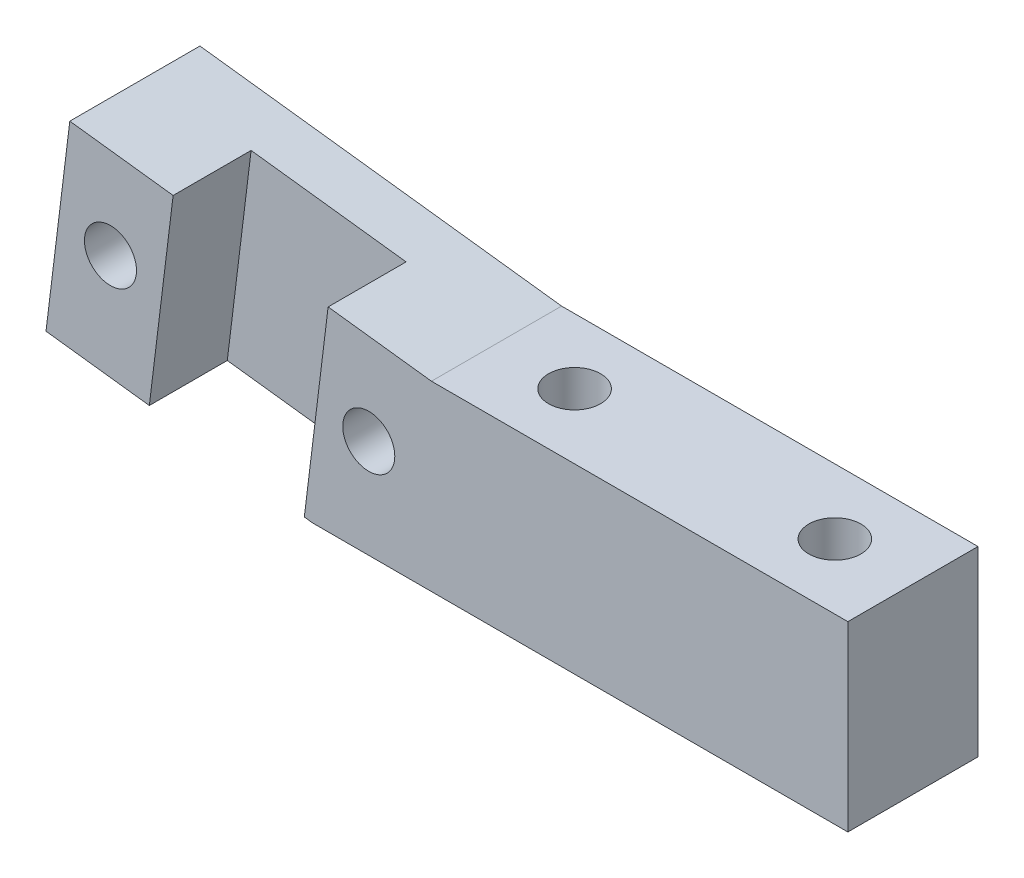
from build123d import *

# Parameters (mm, degrees)
SKETCH2_R           = 3.175
BOSS_EXTRUDE1_DEPTH = 7.9375
CUT_EXTRUDE1_START  = -1.5748
CUT_EXTRUDE1_DEPTH  = 15.875
SKETCH4_R           = 3.175
CUT_EXTRUDE2_DEPTH  = 25.4


with BuildPart() as part:
    # Sketch2 → Boss-Extrude1 (new, symmetric)
    with BuildSketch(Plane.XY):
        Polygon((50.8, -11.1125), (-14.489794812, -11.1125), (-47.022237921, -7.118018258), (-44.11867644, 16.529592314), (0, 11.1125), (50.8, 11.1125), align=None)
        with Locations((-7.646846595, 0.938914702)):
            Circle(SKETCH2_R, mode=Mode.SUBTRACT)
        with Locations((-39.16018691, 4.808266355)):
            Circle(SKETCH2_R, mode=Mode.SUBTRACT)
    extrude(amount=BOSS_EXTRUDE1_DEPTH, both=True)

    # Sketch3 → Cut-Extrude1 (cut)
    with BuildSketch(Plane.XY.offset(CUT_EXTRUDE1_START)):
        Polygon((-15.508897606, -10.987369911), (-34.416901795, -8.665758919), (-31.513340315, 14.981851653), (-12.605336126, 12.660240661), align=None)
    extrude(amount=CUT_EXTRUDE1_DEPTH, mode=Mode.SUBTRACT)

    # Sketch4 → Cut-Extrude2 (cut, symmetric)
    with BuildSketch(Plane(origin=(0, 0, 0), x_dir=(1, 0, 0), z_dir=(0, 1, 0))):
        with Locations(Location((9.525, 0, 0), (0, 0, 180))):
            Circle(SKETCH4_R)
        with Locations(Location((41.275, 0, 0), (0, 0, 180))):
            Circle(SKETCH4_R)
    extrude(amount=CUT_EXTRUDE2_DEPTH, both=True, mode=Mode.SUBTRACT)


solid = part.part
